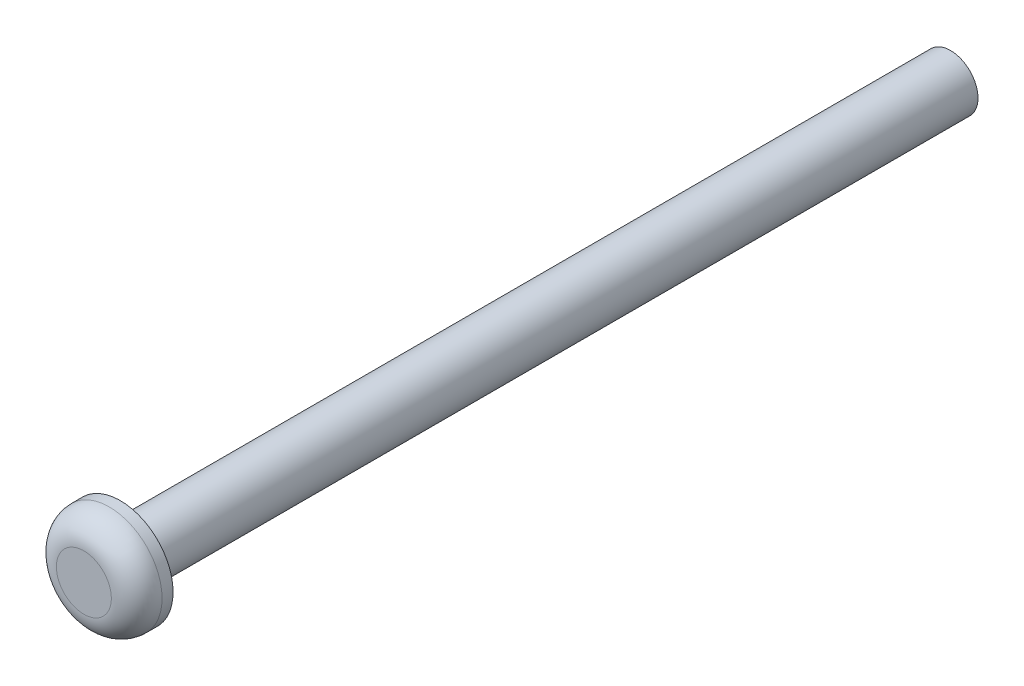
ISO-10303-21;
HEADER;
FILE_DESCRIPTION(('STEP AP214'),'2;1');
FILE_NAME('part.step','',(''),(''),'','','');
FILE_SCHEMA(('AUTOMOTIVE_DESIGN { 1 0 10303 214 1 1 1 1 }'));
ENDSEC;
DATA;
#1=APPLICATION_CONTEXT('core data for automotive mechanical design processes');
#2=APPLICATION_PROTOCOL_DEFINITION('international standard','automotive_design',2000,#1);
#3=PRODUCT_CONTEXT('',#1,'mechanical');
#4=PRODUCT('Part','Part','',(#3));
#5=PRODUCT_RELATED_PRODUCT_CATEGORY('part','',(#4));
#6=PRODUCT_DEFINITION_FORMATION('','',#4);
#7=PRODUCT_DEFINITION_CONTEXT('part definition',#1,'design');
#8=PRODUCT_DEFINITION('design','',#6,#7);
#9=PRODUCT_DEFINITION_SHAPE('','',#8);
#10=(LENGTH_UNIT() NAMED_UNIT(*) SI_UNIT(.MILLI.,.METRE.));
#11=(NAMED_UNIT(*) PLANE_ANGLE_UNIT() SI_UNIT($,.RADIAN.));
#12=(NAMED_UNIT(*) SI_UNIT($,.STERADIAN.) SOLID_ANGLE_UNIT());
#13=UNCERTAINTY_MEASURE_WITH_UNIT(LENGTH_MEASURE(1.E-05),#10,'distance_accuracy_value','');
#14=(GEOMETRIC_REPRESENTATION_CONTEXT(3) GLOBAL_UNCERTAINTY_ASSIGNED_CONTEXT((#13)) GLOBAL_UNIT_ASSIGNED_CONTEXT((#10,
#11,#12)) REPRESENTATION_CONTEXT('',''));
#15=CARTESIAN_POINT('',(0.,0.,0.));
#16=DIRECTION('',(0.,0.,1.));
#17=DIRECTION('',(1.,0.,0.));
#18=AXIS2_PLACEMENT_3D('',#15,#16,#17);
#19=CARTESIAN_POINT('',(0.,0.,2.1844));
#20=DIRECTION('',(0.,0.,-1.));
#21=DIRECTION('',(-1.,0.,0.));
#22=AXIS2_PLACEMENT_3D('',#19,#20,#21);
#23=CYLINDRICAL_SURFACE('',#22,3.175);
#24=CARTESIAN_POINT('',(0.,0.,0.6604));
#25=DIRECTION('',(0.,0.,1.));
#26=DIRECTION('',(1.,0.,0.));
#27=AXIS2_PLACEMENT_3D('',#24,#25,#26);
#28=CIRCLE('',#27,3.175);
#29=CARTESIAN_POINT('',(3.175,0.,0.6604));
#30=VERTEX_POINT('',#29);
#31=EDGE_CURVE('E10',#30,#30,#28,.F.);
#32=ORIENTED_EDGE('',*,*,#31,.T.);
#33=EDGE_LOOP('',(#32));
#34=FACE_BOUND('',#33,.T.);
#35=CARTESIAN_POINT('',(0.,0.,0.));
#36=DIRECTION('',(0.,0.,1.));
#37=DIRECTION('',(1.,0.,0.));
#38=AXIS2_PLACEMENT_3D('',#35,#36,#37);
#39=CIRCLE('',#38,3.175);
#40=CARTESIAN_POINT('',(3.175,0.,0.));
#41=VERTEX_POINT('',#40);
#42=EDGE_CURVE('E44',#41,#41,#39,.T.);
#43=ORIENTED_EDGE('',*,*,#42,.T.);
#44=EDGE_LOOP('',(#43));
#45=FACE_BOUND('',#44,.T.);
#46=ADVANCED_FACE('F33',(#34,#45),#23,.T.);
#47=CARTESIAN_POINT('',(0.,0.,2.1844));
#48=DIRECTION('',(0.,0.,1.));
#49=DIRECTION('',(1.,0.,0.));
#50=AXIS2_PLACEMENT_3D('',#47,#48,#49);
#51=PLANE('',#50);
#52=CARTESIAN_POINT('',(0.,0.,2.1844));
#53=DIRECTION('',(0.,0.,1.));
#54=DIRECTION('',(1.,0.,0.));
#55=AXIS2_PLACEMENT_3D('',#52,#53,#54);
#56=CIRCLE('',#55,1.651);
#57=CARTESIAN_POINT('',(1.651,0.,2.1844));
#58=VERTEX_POINT('',#57);
#59=EDGE_CURVE('E40',#58,#58,#56,.T.);
#60=ORIENTED_EDGE('',*,*,#59,.T.);
#61=EDGE_LOOP('',(#60));
#62=FACE_BOUND('',#61,.T.);
#63=ADVANCED_FACE('F71',(#62),#51,.T.);
#64=CARTESIAN_POINT('',(0.,0.,0.));
#65=DIRECTION('',(0.,0.,1.));
#66=DIRECTION('',(1.,0.,0.));
#67=AXIS2_PLACEMENT_3D('',#64,#65,#66);
#68=PLANE('',#67);
#69=CARTESIAN_POINT('',(0.,0.,0.));
#70=DIRECTION('',(0.,0.,1.));
#71=DIRECTION('',(1.,0.,0.));
#72=AXIS2_PLACEMENT_3D('',#69,#70,#71);
#73=CIRCLE('',#72,1.651);
#74=CARTESIAN_POINT('',(1.651,0.,0.));
#75=VERTEX_POINT('',#74);
#76=EDGE_CURVE('E48',#75,#75,#73,.T.);
#77=ORIENTED_EDGE('',*,*,#76,.T.);
#78=EDGE_LOOP('',(#77));
#79=FACE_BOUND('',#78,.T.);
#80=ORIENTED_EDGE('',*,*,#42,.F.);
#81=EDGE_LOOP('',(#80));
#82=FACE_BOUND('',#81,.T.);
#83=ADVANCED_FACE('F68',(#79,#82),#68,.F.);
#84=CARTESIAN_POINT('',(0.,0.,-49.8856));
#85=DIRECTION('',(0.,0.,1.));
#86=DIRECTION('',(1.,0.,0.));
#87=AXIS2_PLACEMENT_3D('',#84,#85,#86);
#88=CYLINDRICAL_SURFACE('',#87,1.651);
#89=CARTESIAN_POINT('',(0.,0.,-49.8856));
#90=DIRECTION('',(0.,0.,1.));
#91=DIRECTION('',(1.,0.,0.));
#92=AXIS2_PLACEMENT_3D('',#89,#90,#91);
#93=CIRCLE('',#92,1.651);
#94=CARTESIAN_POINT('',(1.651,0.,-49.8856));
#95=VERTEX_POINT('',#94);
#96=EDGE_CURVE('E52',#95,#95,#93,.T.);
#97=ORIENTED_EDGE('',*,*,#96,.T.);
#98=EDGE_LOOP('',(#97));
#99=FACE_BOUND('',#98,.T.);
#100=ORIENTED_EDGE('',*,*,#76,.F.);
#101=EDGE_LOOP('',(#100));
#102=FACE_BOUND('',#101,.T.);
#103=ADVANCED_FACE('F57',(#99,#102),#88,.T.);
#104=CARTESIAN_POINT('',(0.,0.,-49.8856));
#105=DIRECTION('',(0.,0.,1.));
#106=DIRECTION('',(1.,0.,0.));
#107=AXIS2_PLACEMENT_3D('',#104,#105,#106);
#108=PLANE('',#107);
#109=ORIENTED_EDGE('',*,*,#96,.F.);
#110=EDGE_LOOP('',(#109));
#111=FACE_BOUND('',#110,.T.);
#112=ADVANCED_FACE('F60',(#111),#108,.F.);
#113=CARTESIAN_POINT('',(0.,0.,0.6604));
#114=DIRECTION('',(0.,0.,1.));
#115=DIRECTION('',(1.,0.,0.));
#116=AXIS2_PLACEMENT_3D('',#113,#114,#115);
#117=TOROIDAL_SURFACE('',#116,1.651,1.524);
#118=ORIENTED_EDGE('',*,*,#31,.F.);
#119=EDGE_LOOP('',(#118));
#120=FACE_BOUND('',#119,.T.);
#121=ORIENTED_EDGE('',*,*,#59,.F.);
#122=EDGE_LOOP('',(#121));
#123=FACE_BOUND('',#122,.T.);
#124=ADVANCED_FACE('F35',(#120,#123),#117,.T.);
#125=CLOSED_SHELL('',(#46,#63,#83,#103,#112,#124));
#126=MANIFOLD_SOLID_BREP('B2',#125);
#127=ADVANCED_BREP_SHAPE_REPRESENTATION('',(#18,#126),#14);
#128=SHAPE_DEFINITION_REPRESENTATION(#9,#127);
ENDSEC;
END-ISO-10303-21;
